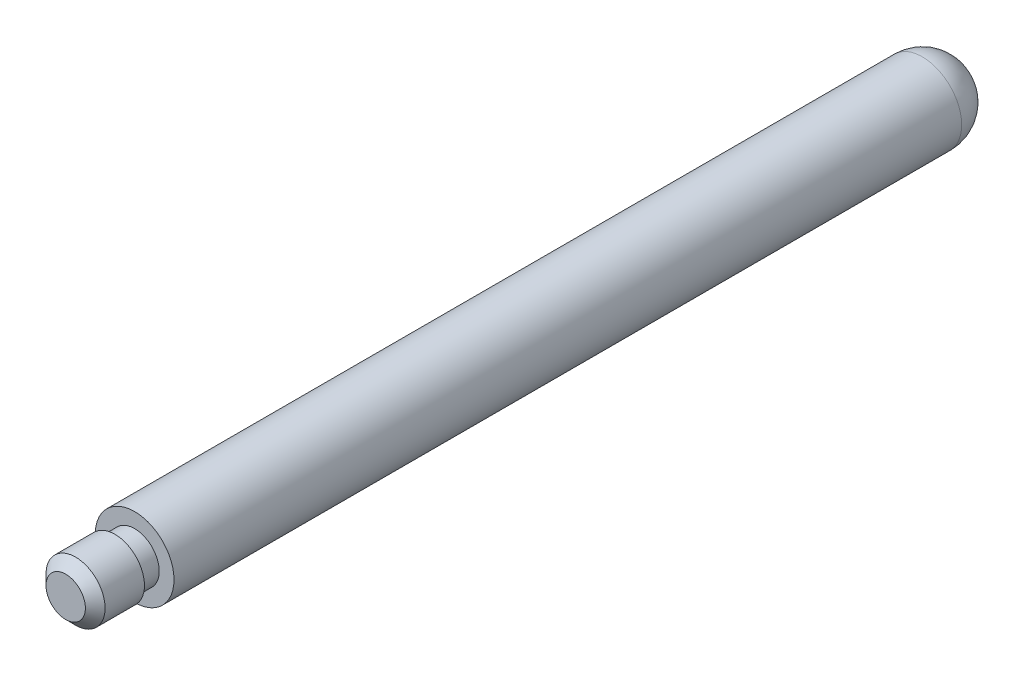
ISO-10303-21;
HEADER;
FILE_DESCRIPTION(('STEP AP214'),'2;1');
FILE_NAME('part.step','',(''),(''),'','','');
FILE_SCHEMA(('AUTOMOTIVE_DESIGN { 1 0 10303 214 1 1 1 1 }'));
ENDSEC;
DATA;
#1=APPLICATION_CONTEXT('core data for automotive mechanical design processes');
#2=APPLICATION_PROTOCOL_DEFINITION('international standard','automotive_design',2000,#1);
#3=PRODUCT_CONTEXT('',#1,'mechanical');
#4=PRODUCT('Part','Part','',(#3));
#5=PRODUCT_RELATED_PRODUCT_CATEGORY('part','',(#4));
#6=PRODUCT_DEFINITION_FORMATION('','',#4);
#7=PRODUCT_DEFINITION_CONTEXT('part definition',#1,'design');
#8=PRODUCT_DEFINITION('design','',#6,#7);
#9=PRODUCT_DEFINITION_SHAPE('','',#8);
#10=(LENGTH_UNIT() NAMED_UNIT(*) SI_UNIT(.MILLI.,.METRE.));
#11=(NAMED_UNIT(*) PLANE_ANGLE_UNIT() SI_UNIT($,.RADIAN.));
#12=(NAMED_UNIT(*) SI_UNIT($,.STERADIAN.) SOLID_ANGLE_UNIT());
#13=UNCERTAINTY_MEASURE_WITH_UNIT(LENGTH_MEASURE(1.E-05),#10,'distance_accuracy_value','');
#14=(GEOMETRIC_REPRESENTATION_CONTEXT(3) GLOBAL_UNCERTAINTY_ASSIGNED_CONTEXT((#13)) GLOBAL_UNIT_ASSIGNED_CONTEXT((#10,
#11,#12)) REPRESENTATION_CONTEXT('',''));
#15=CARTESIAN_POINT('',(0.,0.,0.));
#16=DIRECTION('',(0.,0.,1.));
#17=DIRECTION('',(1.,0.,0.));
#18=AXIS2_PLACEMENT_3D('',#15,#16,#17);
#19=CARTESIAN_POINT('',(0.,0.,80.));
#20=DIRECTION('',(0.,0.,-1.));
#21=DIRECTION('',(-1.,0.,0.));
#22=AXIS2_PLACEMENT_3D('',#19,#20,#21);
#23=CYLINDRICAL_SURFACE('',#22,4.);
#24=CARTESIAN_POINT('',(0.,0.,80.));
#25=DIRECTION('',(0.,0.,1.));
#26=DIRECTION('',(1.,0.,0.));
#27=AXIS2_PLACEMENT_3D('',#24,#25,#26);
#28=CIRCLE('',#27,4.);
#29=CARTESIAN_POINT('',(4.,0.,80.));
#30=VERTEX_POINT('',#29);
#31=EDGE_CURVE('E62',#30,#30,#28,.T.);
#32=ORIENTED_EDGE('',*,*,#31,.F.);
#33=EDGE_LOOP('',(#32));
#34=FACE_BOUND('',#33,.T.);
#35=CARTESIAN_POINT('',(0.,0.,0.));
#36=DIRECTION('',(0.,0.,1.));
#37=DIRECTION('',(1.,0.,0.));
#38=AXIS2_PLACEMENT_3D('',#35,#36,#37);
#39=CIRCLE('',#38,4.);
#40=CARTESIAN_POINT('',(4.,0.,0.));
#41=VERTEX_POINT('',#40);
#42=EDGE_CURVE('E51',#41,#41,#39,.T.);
#43=ORIENTED_EDGE('',*,*,#42,.T.);
#44=EDGE_LOOP('',(#43));
#45=FACE_BOUND('',#44,.T.);
#46=ADVANCED_FACE('F47',(#34,#45),#23,.T.);
#47=CARTESIAN_POINT('',(0.,0.,80.));
#48=DIRECTION('',(0.,0.,1.));
#49=DIRECTION('',(1.,0.,0.));
#50=AXIS2_PLACEMENT_3D('',#47,#48,#49);
#51=PLANE('',#50);
#52=CARTESIAN_POINT('',(0.,0.,80.));
#53=DIRECTION('',(0.,0.,1.));
#54=DIRECTION('',(1.,0.,0.));
#55=AXIS2_PLACEMENT_3D('',#52,#53,#54);
#56=CIRCLE('',#55,2.5);
#57=CARTESIAN_POINT('',(2.5,0.,80.));
#58=VERTEX_POINT('',#57);
#59=EDGE_CURVE('E59',#58,#58,#56,.T.);
#60=ORIENTED_EDGE('',*,*,#59,.F.);
#61=EDGE_LOOP('',(#60));
#62=FACE_BOUND('',#61,.T.);
#63=ORIENTED_EDGE('',*,*,#31,.T.);
#64=EDGE_LOOP('',(#63));
#65=FACE_BOUND('',#64,.T.);
#66=ADVANCED_FACE('F93',(#62,#65),#51,.T.);
#67=CARTESIAN_POINT('',(0.,0.,0.));
#68=DIRECTION('',(0.,0.,1.));
#69=DIRECTION('',(1.,0.,0.));
#70=AXIS2_PLACEMENT_3D('',#67,#68,#69);
#71=SPHERICAL_SURFACE('',#70,4.);
#72=ORIENTED_EDGE('',*,*,#42,.F.);
#73=EDGE_LOOP('',(#72));
#74=FACE_BOUND('',#73,.T.);
#75=ADVANCED_FACE('F49',(#74),#71,.T.);
#76=CARTESIAN_POINT('',(0.,0.,82.));
#77=DIRECTION('',(0.,0.,-1.));
#78=DIRECTION('',(-1.,0.,0.));
#79=AXIS2_PLACEMENT_3D('',#76,#77,#78);
#80=CYLINDRICAL_SURFACE('',#79,2.5);
#81=CARTESIAN_POINT('',(0.,0.,82.));
#82=DIRECTION('',(0.,0.,1.));
#83=DIRECTION('',(1.,0.,0.));
#84=AXIS2_PLACEMENT_3D('',#81,#82,#83);
#85=CIRCLE('',#84,2.5);
#86=CARTESIAN_POINT('',(2.5,0.,82.));
#87=VERTEX_POINT('',#86);
#88=EDGE_CURVE('E67',#87,#87,#85,.T.);
#89=ORIENTED_EDGE('',*,*,#88,.F.);
#90=EDGE_LOOP('',(#89));
#91=FACE_BOUND('',#90,.T.);
#92=ORIENTED_EDGE('',*,*,#59,.T.);
#93=EDGE_LOOP('',(#92));
#94=FACE_BOUND('',#93,.T.);
#95=ADVANCED_FACE('F109',(#91,#94),#80,.T.);
#96=CARTESIAN_POINT('',(0.,0.,87.));
#97=DIRECTION('',(0.,0.,-1.));
#98=DIRECTION('',(-1.,0.,0.));
#99=AXIS2_PLACEMENT_3D('',#96,#97,#98);
#100=CYLINDRICAL_SURFACE('',#99,3.);
#101=CARTESIAN_POINT('',(0.,0.,86.));
#102=DIRECTION('',(0.,0.,1.));
#103=DIRECTION('',(1.,0.,0.));
#104=AXIS2_PLACEMENT_3D('',#101,#102,#103);
#105=CIRCLE('',#104,3.);
#106=CARTESIAN_POINT('',(3.,0.,86.));
#107=VERTEX_POINT('',#106);
#108=EDGE_CURVE('E10',#107,#107,#105,.F.);
#109=ORIENTED_EDGE('',*,*,#108,.T.);
#110=EDGE_LOOP('',(#109));
#111=FACE_BOUND('',#110,.T.);
#112=CARTESIAN_POINT('',(0.,0.,82.));
#113=DIRECTION('',(0.,0.,1.));
#114=DIRECTION('',(1.,0.,0.));
#115=AXIS2_PLACEMENT_3D('',#112,#113,#114);
#116=CIRCLE('',#115,3.);
#117=CARTESIAN_POINT('',(3.,0.,82.));
#118=VERTEX_POINT('',#117);
#119=EDGE_CURVE('E70',#118,#118,#116,.T.);
#120=ORIENTED_EDGE('',*,*,#119,.T.);
#121=EDGE_LOOP('',(#120));
#122=FACE_BOUND('',#121,.T.);
#123=ADVANCED_FACE('F74',(#111,#122),#100,.T.);
#124=CARTESIAN_POINT('',(0.,0.,87.));
#125=DIRECTION('',(0.,0.,1.));
#126=DIRECTION('',(1.,0.,0.));
#127=AXIS2_PLACEMENT_3D('',#124,#125,#126);
#128=PLANE('',#127);
#129=CARTESIAN_POINT('',(0.,0.,87.));
#130=DIRECTION('',(0.,0.,1.));
#131=DIRECTION('',(1.,0.,0.));
#132=AXIS2_PLACEMENT_3D('',#129,#130,#131);
#133=CIRCLE('',#132,2.);
#134=CARTESIAN_POINT('',(2.,0.,87.));
#135=VERTEX_POINT('',#134);
#136=EDGE_CURVE('E55',#135,#135,#133,.T.);
#137=ORIENTED_EDGE('',*,*,#136,.T.);
#138=EDGE_LOOP('',(#137));
#139=FACE_BOUND('',#138,.T.);
#140=ADVANCED_FACE('F79',(#139),#128,.T.);
#141=CARTESIAN_POINT('',(0.,0.,82.));
#142=DIRECTION('',(0.,0.,1.));
#143=DIRECTION('',(1.,0.,0.));
#144=AXIS2_PLACEMENT_3D('',#141,#142,#143);
#145=PLANE('',#144);
#146=ORIENTED_EDGE('',*,*,#88,.T.);
#147=EDGE_LOOP('',(#146));
#148=FACE_BOUND('',#147,.T.);
#149=ORIENTED_EDGE('',*,*,#119,.F.);
#150=EDGE_LOOP('',(#149));
#151=FACE_BOUND('',#150,.T.);
#152=ADVANCED_FACE('F76',(#148,#151),#145,.F.);
#153=CARTESIAN_POINT('',(0.,0.,87.));
#154=DIRECTION('',(0.,0.,-1.));
#155=DIRECTION('',(-1.,0.,0.));
#156=AXIS2_PLACEMENT_3D('',#153,#154,#155);
#157=CONICAL_SURFACE('',#156,2.,0.785398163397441);
#158=ORIENTED_EDGE('',*,*,#108,.F.);
#159=EDGE_LOOP('',(#158));
#160=FACE_BOUND('',#159,.T.);
#161=ORIENTED_EDGE('',*,*,#136,.F.);
#162=EDGE_LOOP('',(#161));
#163=FACE_BOUND('',#162,.T.);
#164=ADVANCED_FACE('F78',(#160,#163),#157,.T.);
#165=CLOSED_SHELL('',(#46,#66,#75,#95,#123,#140,#152,#164));
#166=MANIFOLD_SOLID_BREP('B2',#165);
#167=ADVANCED_BREP_SHAPE_REPRESENTATION('',(#18,#166),#14);
#168=SHAPE_DEFINITION_REPRESENTATION(#9,#167);
ENDSEC;
END-ISO-10303-21;
